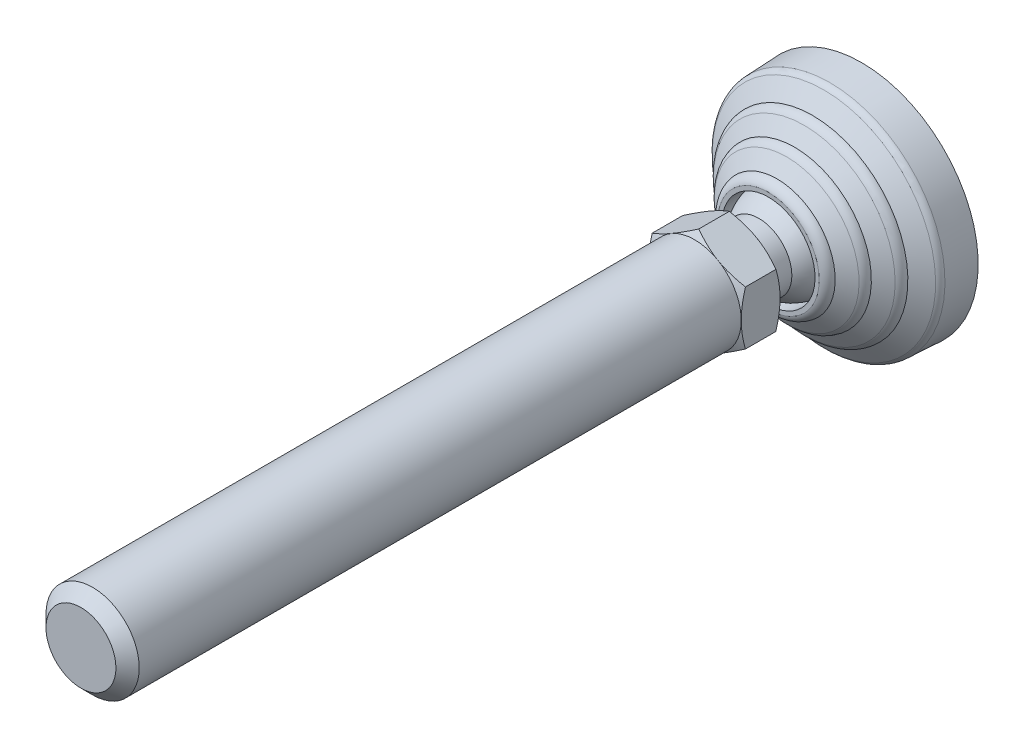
ISO-10303-21;
HEADER;
FILE_DESCRIPTION(('STEP AP214'),'2;1');
FILE_NAME('part.step','',(''),(''),'','','');
FILE_SCHEMA(('AUTOMOTIVE_DESIGN { 1 0 10303 214 1 1 1 1 }'));
ENDSEC;
DATA;
#1=APPLICATION_CONTEXT('core data for automotive mechanical design processes');
#2=APPLICATION_PROTOCOL_DEFINITION('international standard','automotive_design',2000,#1);
#3=PRODUCT_CONTEXT('',#1,'mechanical');
#4=PRODUCT('Part','Part','',(#3));
#5=PRODUCT_RELATED_PRODUCT_CATEGORY('part','',(#4));
#6=PRODUCT_DEFINITION_FORMATION('','',#4);
#7=PRODUCT_DEFINITION_CONTEXT('part definition',#1,'design');
#8=PRODUCT_DEFINITION('design','',#6,#7);
#9=PRODUCT_DEFINITION_SHAPE('','',#8);
#10=(LENGTH_UNIT() NAMED_UNIT(*) SI_UNIT(.MILLI.,.METRE.));
#11=(NAMED_UNIT(*) PLANE_ANGLE_UNIT() SI_UNIT($,.RADIAN.));
#12=(NAMED_UNIT(*) SI_UNIT($,.STERADIAN.) SOLID_ANGLE_UNIT());
#13=UNCERTAINTY_MEASURE_WITH_UNIT(LENGTH_MEASURE(1.E-05),#10,'distance_accuracy_value','');
#14=(GEOMETRIC_REPRESENTATION_CONTEXT(3) GLOBAL_UNCERTAINTY_ASSIGNED_CONTEXT((#13)) GLOBAL_UNIT_ASSIGNED_CONTEXT((#10,
#11,#12)) REPRESENTATION_CONTEXT('',''));
#15=CARTESIAN_POINT('',(0.,0.,0.));
#16=DIRECTION('',(0.,0.,1.));
#17=DIRECTION('',(1.,0.,0.));
#18=AXIS2_PLACEMENT_3D('',#15,#16,#17);
#19=CARTESIAN_POINT('',(0.,0.,30.));
#20=DIRECTION('',(0.,0.,-1.));
#21=DIRECTION('',(0.,1.,0.));
#22=AXIS2_PLACEMENT_3D('',#19,#20,#21);
#23=CYLINDRICAL_SURFACE('',#22,12.);
#24=CARTESIAN_POINT('',(-12.,0.,18.));
#25=CARTESIAN_POINT('',(-12.0000041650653,-0.196349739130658,18.));
#26=CARTESIAN_POINT('',(-11.9951810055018,-0.392699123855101,18.));
#27=CARTESIAN_POINT('',(-11.9759099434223,-0.784925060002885,18.));
#28=CARTESIAN_POINT('',(-11.9614620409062,-0.980801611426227,18.));
#29=CARTESIAN_POINT('',(-11.9229713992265,-1.37160975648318,18.));
#30=CARTESIAN_POINT('',(-11.8989286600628,-1.5665413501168,18.));
#31=CARTESIAN_POINT('',(-11.841307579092,-1.95499003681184,18.));
#32=CARTESIAN_POINT('',(-11.8077292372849,-2.14850712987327,18.));
#33=CARTESIAN_POINT('',(-11.7311174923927,-2.53366059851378,18.));
#34=CARTESIAN_POINT('',(-11.6880840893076,-2.72529697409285,18.));
#35=CARTESIAN_POINT('',(-11.5926659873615,-3.10622734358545,18.));
#36=CARTESIAN_POINT('',(-11.5402812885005,-3.29552133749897,18.));
#37=CARTESIAN_POINT('',(-11.4262867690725,-3.67131091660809,18.));
#38=CARTESIAN_POINT('',(-11.3646769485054,-3.85780650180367,18.));
#39=CARTESIAN_POINT('',(-11.2323806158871,-4.22754997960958,18.));
#40=CARTESIAN_POINT('',(-11.1616941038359,-4.41079787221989,18.));
#41=CARTESIAN_POINT('',(-11.011414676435,-4.77360450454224,18.));
#42=CARTESIAN_POINT('',(-10.9318217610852,-4.95316324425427,18.));
#43=CARTESIAN_POINT('',(-10.7639212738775,-5.30815899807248,18.));
#44=CARTESIAN_POINT('',(-10.6756137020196,-5.48359601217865,18.));
#45=CARTESIAN_POINT('',(-10.4904966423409,-5.82992567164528,17.9999999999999));
#46=CARTESIAN_POINT('',(-10.3936871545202,-6.00081831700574,17.9999999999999));
#47=CARTESIAN_POINT('',(-10.1917994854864,-6.33764754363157,17.9999999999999));
#48=CARTESIAN_POINT('',(-10.0867213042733,-6.50358412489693,17.9999999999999));
#49=CARTESIAN_POINT('',(-9.8685493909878,-6.83010146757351,17.9999999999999));
#50=CARTESIAN_POINT('',(-9.75545565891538,-6.99068222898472,17.9999999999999));
#51=CARTESIAN_POINT('',(-9.5215250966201,-7.30610107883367,17.9999999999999));
#52=CARTESIAN_POINT('',(-9.40068826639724,-7.4609391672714,17.9999999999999));
#53=CARTESIAN_POINT('',(-9.15156261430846,-7.76449965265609,17.9999999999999));
#54=CARTESIAN_POINT('',(-9.02327379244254,-7.91322204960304,17.9999999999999));
#55=CARTESIAN_POINT('',(-8.75955321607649,-8.20419286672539,17.9999999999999));
#56=CARTESIAN_POINT('',(-8.62412146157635,-8.3464412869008,17.9999999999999));
#57=CARTESIAN_POINT('',(-8.3464412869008,-8.62412146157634,17.9999999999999));
#58=CARTESIAN_POINT('',(-8.2041928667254,-8.75955321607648,17.9999999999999));
#59=CARTESIAN_POINT('',(-7.91322204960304,-9.02327379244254,17.9999999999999));
#60=CARTESIAN_POINT('',(-7.76449965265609,-9.15156261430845,17.9999999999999));
#61=CARTESIAN_POINT('',(-7.4609391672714,-9.40068826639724,17.9999999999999));
#62=CARTESIAN_POINT('',(-7.30610107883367,-9.5215250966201,17.9999999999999));
#63=CARTESIAN_POINT('',(-6.99068222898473,-9.75545565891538,17.9999999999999));
#64=CARTESIAN_POINT('',(-6.83010146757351,-9.8685493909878,17.9999999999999));
#65=CARTESIAN_POINT('',(-6.50358412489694,-10.0867213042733,17.9999999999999));
#66=CARTESIAN_POINT('',(-6.33764754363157,-10.1917994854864,17.9999999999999));
#67=CARTESIAN_POINT('',(-6.00081831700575,-10.3936871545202,17.9999999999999));
#68=CARTESIAN_POINT('',(-5.82992567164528,-10.4904966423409,17.9999999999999));
#69=CARTESIAN_POINT('',(-5.48359601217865,-10.6756137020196,17.9999999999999));
#70=CARTESIAN_POINT('',(-5.30815899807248,-10.7639212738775,17.9999999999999));
#71=CARTESIAN_POINT('',(-4.95316324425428,-10.9318217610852,17.9999999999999));
#72=CARTESIAN_POINT('',(-4.77360450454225,-11.011414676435,17.9999999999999));
#73=CARTESIAN_POINT('',(-4.4107978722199,-11.1616941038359,17.9999999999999));
#74=CARTESIAN_POINT('',(-4.22754997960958,-11.2323806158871,17.9999999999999));
#75=CARTESIAN_POINT('',(-3.85780650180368,-11.3646769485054,17.9999999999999));
#76=CARTESIAN_POINT('',(-3.67131091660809,-11.4262867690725,17.9999999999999));
#77=CARTESIAN_POINT('',(-3.29552133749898,-11.5402812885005,17.9999999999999));
#78=CARTESIAN_POINT('',(-3.10622734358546,-11.5926659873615,17.9999999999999));
#79=CARTESIAN_POINT('',(-2.72529697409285,-11.6880840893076,17.9999999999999));
#80=CARTESIAN_POINT('',(-2.53366059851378,-11.7311174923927,17.9999999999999));
#81=CARTESIAN_POINT('',(-2.14850712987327,-11.8077292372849,17.9999999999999));
#82=CARTESIAN_POINT('',(-1.95499003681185,-11.841307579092,17.9999999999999));
#83=CARTESIAN_POINT('',(-1.5665413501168,-11.8989286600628,17.9999999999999));
#84=CARTESIAN_POINT('',(-1.37160975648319,-11.9229713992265,17.9999999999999));
#85=CARTESIAN_POINT('',(-0.980801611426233,-11.9614620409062,17.9999999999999));
#86=CARTESIAN_POINT('',(-0.78492506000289,-11.9759099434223,17.9999999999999));
#87=CARTESIAN_POINT('',(-0.392699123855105,-11.9951810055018,17.9999999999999));
#88=CARTESIAN_POINT('',(-0.196349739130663,-12.0000041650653,17.9999999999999));
#89=CARTESIAN_POINT('',(0.,-12.,17.9999999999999));
#90=B_SPLINE_CURVE_WITH_KNOTS('',3,(#24,#25,#26,#27,#28,#29,#30,#31,#32,#33,#34,#35,#36,#37,#38,
#39,#40,#41,#42,#43,#44,#45,#46,#47,#48,#49,#50,#51,#52,#53,#54,#55,#56,#57,#58,#59,#60,#61,#62,
#63,#64,#65,#66,#67,#68,#69,#70,#71,#72,#73,#74,#75,#76,#77,#78,#79,#80,#81,#82,#83,#84,#85,#86,
#87,#88,#89),.UNSPECIFIED.,.F.,.F.,(4,2,2,2,2,2,2,2,2,2,2,2,2,2,2,2,2,2,2,2,2,2,2,2,2,2,2,2,2,2,
2,2,4),(0.,0.588989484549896,1.17797896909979,1.76696845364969,2.35595793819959,
2.94494742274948,3.53393690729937,4.12292639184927,4.71191587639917,5.30090536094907,
5.88989484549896,6.47888433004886,7.06787381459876,7.65686329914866,8.24585278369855,
8.83484226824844,9.42383175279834,10.0128212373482,10.6018107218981,11.190800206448,
11.7797896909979,12.3687791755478,12.9577686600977,13.5467581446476,14.1357476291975,
14.7247371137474,15.3137265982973,15.9027160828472,16.4917055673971,17.080695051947,
17.6696845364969,18.2586740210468,18.8476635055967),.UNSPECIFIED.);
#91=CARTESIAN_POINT('',(-12.,0.,18.00017943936));
#92=VERTEX_POINT('',#91);
#93=CARTESIAN_POINT('',(0.,-12.,18.));
#94=VERTEX_POINT('',#93);
#95=EDGE_CURVE('E138',#92,#94,#90,.T.);
#96=ORIENTED_EDGE('',*,*,#95,.F.);
#97=CARTESIAN_POINT('',(0.,0.,18.));
#98=DIRECTION('',(0.,0.,-1.));
#99=DIRECTION('',(0.,1.,0.));
#100=AXIS2_PLACEMENT_3D('',#97,#98,#99);
#101=CIRCLE('',#100,12.);
#102=CARTESIAN_POINT('',(0.,12.,18.));
#103=VERTEX_POINT('',#102);
#104=EDGE_CURVE('E134',#103,#92,#101,.F.);
#105=ORIENTED_EDGE('',*,*,#104,.F.);
#106=CARTESIAN_POINT('',(12.,0.,18.));
#107=CARTESIAN_POINT('',(12.0000041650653,0.196349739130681,18.));
#108=CARTESIAN_POINT('',(11.9951810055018,0.392699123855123,18.));
#109=CARTESIAN_POINT('',(11.9759099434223,0.784925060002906,18.));
#110=CARTESIAN_POINT('',(11.9614620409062,0.980801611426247,18.));
#111=CARTESIAN_POINT('',(11.9229713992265,1.3716097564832,18.));
#112=CARTESIAN_POINT('',(11.8989286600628,1.56654135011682,18.));
#113=CARTESIAN_POINT('',(11.841307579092,1.95499003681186,18.));
#114=CARTESIAN_POINT('',(11.8077292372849,2.14850712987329,18.));
#115=CARTESIAN_POINT('',(11.7311174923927,2.53366059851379,18.));
#116=CARTESIAN_POINT('',(11.6880840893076,2.72529697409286,18.));
#117=CARTESIAN_POINT('',(11.5926659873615,3.10622734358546,18.));
#118=CARTESIAN_POINT('',(11.5402812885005,3.29552133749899,18.));
#119=CARTESIAN_POINT('',(11.4262867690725,3.6713109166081,18.));
#120=CARTESIAN_POINT('',(11.3646769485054,3.85780650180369,18.));
#121=CARTESIAN_POINT('',(11.2323806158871,4.22754997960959,18.));
#122=CARTESIAN_POINT('',(11.1616941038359,4.4107978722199,18.));
#123=CARTESIAN_POINT('',(11.011414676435,4.77360450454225,18.));
#124=CARTESIAN_POINT('',(10.9318217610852,4.95316324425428,18.));
#125=CARTESIAN_POINT('',(10.7639212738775,5.30815899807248,18.));
#126=CARTESIAN_POINT('',(10.6756137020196,5.48359601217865,18.));
#127=CARTESIAN_POINT('',(10.4904966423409,5.82992567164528,18.));
#128=CARTESIAN_POINT('',(10.3936871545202,6.00081831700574,18.));
#129=CARTESIAN_POINT('',(10.1917994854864,6.33764754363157,18.));
#130=CARTESIAN_POINT('',(10.0867213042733,6.50358412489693,18.));
#131=CARTESIAN_POINT('',(9.8685493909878,6.83010146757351,18.));
#132=CARTESIAN_POINT('',(9.75545565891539,6.99068222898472,18.));
#133=CARTESIAN_POINT('',(9.5215250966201,7.30610107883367,18.));
#134=CARTESIAN_POINT('',(9.40068826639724,7.4609391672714,18.));
#135=CARTESIAN_POINT('',(9.15156261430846,7.76449965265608,18.));
#136=CARTESIAN_POINT('',(9.02327379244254,7.91322204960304,18.));
#137=CARTESIAN_POINT('',(8.75955321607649,8.20419286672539,18.));
#138=CARTESIAN_POINT('',(8.62412146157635,8.3464412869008,18.));
#139=CARTESIAN_POINT('',(8.34644128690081,8.62412146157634,18.));
#140=CARTESIAN_POINT('',(8.20419286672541,8.75955321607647,18.));
#141=CARTESIAN_POINT('',(7.91322204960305,9.02327379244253,18.));
#142=CARTESIAN_POINT('',(7.7644996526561,9.15156261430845,18.));
#143=CARTESIAN_POINT('',(7.46093916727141,9.40068826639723,18.));
#144=CARTESIAN_POINT('',(7.30610107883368,9.52152509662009,18.));
#145=CARTESIAN_POINT('',(6.99068222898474,9.75545565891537,18.));
#146=CARTESIAN_POINT('',(6.83010146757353,9.86854939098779,18.));
#147=CARTESIAN_POINT('',(6.50358412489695,10.0867213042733,18.));
#148=CARTESIAN_POINT('',(6.33764754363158,10.1917994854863,18.));
#149=CARTESIAN_POINT('',(6.00081831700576,10.3936871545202,18.));
#150=CARTESIAN_POINT('',(5.8299256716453,10.4904966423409,18.));
#151=CARTESIAN_POINT('',(5.48359601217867,10.6756137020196,18.));
#152=CARTESIAN_POINT('',(5.3081589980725,10.7639212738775,18.));
#153=CARTESIAN_POINT('',(4.9531632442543,10.9318217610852,18.));
#154=CARTESIAN_POINT('',(4.77360450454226,11.0114146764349,18.));
#155=CARTESIAN_POINT('',(4.41079787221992,11.1616941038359,18.));
#156=CARTESIAN_POINT('',(4.2275499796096,11.2323806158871,18.));
#157=CARTESIAN_POINT('',(3.85780650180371,11.3646769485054,18.));
#158=CARTESIAN_POINT('',(3.67131091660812,11.4262867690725,18.));
#159=CARTESIAN_POINT('',(3.29552133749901,11.5402812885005,18.));
#160=CARTESIAN_POINT('',(3.10622734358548,11.5926659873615,18.));
#161=CARTESIAN_POINT('',(2.72529697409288,11.6880840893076,18.));
#162=CARTESIAN_POINT('',(2.53366059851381,11.7311174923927,18.));
#163=CARTESIAN_POINT('',(2.1485071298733,11.8077292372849,18.));
#164=CARTESIAN_POINT('',(1.95499003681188,11.841307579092,18.));
#165=CARTESIAN_POINT('',(1.56654135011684,11.8989286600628,18.));
#166=CARTESIAN_POINT('',(1.37160975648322,11.9229713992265,18.));
#167=CARTESIAN_POINT('',(0.980801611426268,11.9614620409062,18.));
#168=CARTESIAN_POINT('',(0.784925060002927,11.9759099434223,18.));
#169=CARTESIAN_POINT('',(0.392699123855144,11.9951810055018,18.));
#170=CARTESIAN_POINT('',(0.196349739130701,12.0000041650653,18.));
#171=CARTESIAN_POINT('',(0.,12.,18.));
#172=B_SPLINE_CURVE_WITH_KNOTS('',3,(#106,#107,#108,#109,#110,#111,#112,#113,#114,#115,#116,
#117,#118,#119,#120,#121,#122,#123,#124,#125,#126,#127,#128,#129,#130,#131,#132,#133,#134,#135,
#136,#137,#138,#139,#140,#141,#142,#143,#144,#145,#146,#147,#148,#149,#150,#151,#152,#153,#154,
#155,#156,#157,#158,#159,#160,#161,#162,#163,#164,#165,#166,#167,#168,#169,#170,#171),
.UNSPECIFIED.,.F.,.F.,(4,2,2,2,2,2,2,2,2,2,2,2,2,2,2,2,2,2,2,2,2,2,2,2,2,2,2,2,2,2,2,2,4),(0.,
0.588989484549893,1.17797896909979,1.76696845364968,2.35595793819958,2.94494742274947,
3.53393690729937,4.12292639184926,4.71191587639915,5.30090536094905,5.88989484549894,
6.47888433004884,7.06787381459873,7.65686329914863,8.24585278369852,8.83484226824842,
9.42383175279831,10.0128212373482,10.6018107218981,11.190800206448,11.7797896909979,
12.3687791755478,12.9577686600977,13.5467581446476,14.1357476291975,14.7247371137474,
15.3137265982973,15.9027160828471,16.491705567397,17.0806950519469,17.6696845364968,
18.2586740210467,18.8476635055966),.UNSPECIFIED.);
#173=CARTESIAN_POINT('',(12.,0.,18.));
#174=VERTEX_POINT('',#173);
#175=EDGE_CURVE('E31',#174,#103,#172,.T.);
#176=ORIENTED_EDGE('',*,*,#175,.F.);
#177=CARTESIAN_POINT('',(0.,0.,18.));
#178=DIRECTION('',(0.,0.,-1.));
#179=DIRECTION('',(0.,1.,0.));
#180=AXIS2_PLACEMENT_3D('',#177,#178,#179);
#181=CIRCLE('',#180,12.);
#182=EDGE_CURVE('E135',#94,#174,#181,.F.);
#183=ORIENTED_EDGE('',*,*,#182,.F.);
#184=EDGE_LOOP('',(#96,#105,#176,#183));
#185=FACE_BOUND('',#184,.T.);
#186=CARTESIAN_POINT('',(0.,0.,24.));
#187=DIRECTION('',(0.,0.,-1.));
#188=DIRECTION('',(0.,1.,0.));
#189=AXIS2_PLACEMENT_3D('',#186,#187,#188);
#190=CIRCLE('',#189,12.);
#191=CARTESIAN_POINT('',(0.,12.,24.));
#192=VERTEX_POINT('',#191);
#193=EDGE_CURVE('E155',#192,#192,#190,.T.);
#194=ORIENTED_EDGE('',*,*,#193,.F.);
#195=EDGE_LOOP('',(#194));
#196=FACE_BOUND('',#195,.T.);
#197=ADVANCED_FACE('F14',(#185,#196),#23,.F.);
#198=CARTESIAN_POINT('',(-6.53226682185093,0.,24.));
#199=DIRECTION('',(0.,0.,1.));
#200=DIRECTION('',(-1.,0.,0.));
#201=AXIS2_PLACEMENT_3D('',#198,#199,#200);
#202=PLANE('',#201);
#203=CARTESIAN_POINT('',(0.,0.,24.));
#204=DIRECTION('',(0.,0.,-1.));
#205=DIRECTION('',(0.,1.,0.));
#206=AXIS2_PLACEMENT_3D('',#203,#204,#205);
#207=CIRCLE('',#206,13.0645336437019);
#208=CARTESIAN_POINT('',(0.,13.0645336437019,24.));
#209=VERTEX_POINT('',#208);
#210=EDGE_CURVE('E151',#209,#209,#207,.T.);
#211=ORIENTED_EDGE('',*,*,#210,.F.);
#212=EDGE_LOOP('',(#211));
#213=FACE_BOUND('',#212,.T.);
#214=ORIENTED_EDGE('',*,*,#193,.T.);
#215=EDGE_LOOP('',(#214));
#216=FACE_BOUND('',#215,.T.);
#217=ADVANCED_FACE('F304',(#213,#216),#202,.T.);
#218=CARTESIAN_POINT('',(0.,0.,21.5842));
#219=DIRECTION('',(0.,0.,-1.));
#220=DIRECTION('',(0.,1.,0.));
#221=AXIS2_PLACEMENT_3D('',#218,#219,#220);
#222=TOROIDAL_SURFACE('',#221,12.5253,2.47525);
#223=ORIENTED_EDGE('',*,*,#210,.T.);
#224=EDGE_LOOP('',(#223));
#225=FACE_BOUND('',#224,.T.);
#226=CARTESIAN_POINT('',(0.,0.,21.8062186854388));
#227=DIRECTION('',(0.,0.,-1.));
#228=DIRECTION('',(-1.,0.,0.));
#229=AXIS2_PLACEMENT_3D('',#226,#227,#228);
#230=CIRCLE('',#229,14.9905728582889);
#231=CARTESIAN_POINT('',(-14.9905728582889,0.,21.8062186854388));
#232=VERTEX_POINT('',#231);
#233=EDGE_CURVE('E154',#232,#232,#230,.T.);
#234=ORIENTED_EDGE('',*,*,#233,.F.);
#235=EDGE_LOOP('',(#234));
#236=FACE_BOUND('',#235,.T.);
#237=ADVANCED_FACE('F382',(#225,#236),#222,.T.);
#238=CARTESIAN_POINT('',(0.,0.,19.3004110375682));
#239=DIRECTION('',(0.,0.,-1.));
#240=DIRECTION('',(0.,1.,0.));
#241=AXIS2_PLACEMENT_3D('',#238,#239,#240);
#242=CONICAL_SURFACE('',#241,18.63040749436,0.967870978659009);
#243=ORIENTED_EDGE('',*,*,#233,.T.);
#244=EDGE_LOOP('',(#243));
#245=FACE_BOUND('',#244,.T.);
#246=CARTESIAN_POINT('',(0.,0.,19.3004110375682));
#247=DIRECTION('',(0.,0.,-1.));
#248=DIRECTION('',(0.,1.,0.));
#249=AXIS2_PLACEMENT_3D('',#246,#247,#248);
#250=CIRCLE('',#249,18.63040749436);
#251=CARTESIAN_POINT('',(0.,18.63040749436,19.3004110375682));
#252=VERTEX_POINT('',#251);
#253=EDGE_CURVE('E376',#252,#252,#250,.T.);
#254=ORIENTED_EDGE('',*,*,#253,.F.);
#255=EDGE_LOOP('',(#254));
#256=FACE_BOUND('',#255,.T.);
#257=ADVANCED_FACE('F369',(#245,#256),#242,.T.);
#258=CARTESIAN_POINT('',(0.,0.,17.149417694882));
#259=DIRECTION('',(0.,0.,-1.));
#260=DIRECTION('',(0.,1.,0.));
#261=AXIS2_PLACEMENT_3D('',#258,#259,#260);
#262=TOROIDAL_SURFACE('',#261,17.1699621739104,2.59993709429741);
#263=CARTESIAN_POINT('',(0.,0.,17.266146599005));
#264=DIRECTION('',(0.,0.,-1.));
#265=DIRECTION('',(-1.,0.,0.));
#266=AXIS2_PLACEMENT_3D('',#263,#264,#265);
#267=CIRCLE('',#266,19.7672775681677);
#268=CARTESIAN_POINT('',(-19.7672775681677,0.,17.266146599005));
#269=VERTEX_POINT('',#268);
#270=EDGE_CURVE('E373',#269,#269,#267,.T.);
#271=ORIENTED_EDGE('',*,*,#270,.F.);
#272=EDGE_LOOP('',(#271));
#273=FACE_BOUND('',#272,.T.);
#274=ORIENTED_EDGE('',*,*,#253,.T.);
#275=EDGE_LOOP('',(#274));
#276=FACE_BOUND('',#275,.T.);
#277=ADVANCED_FACE('F365',(#273,#276),#262,.T.);
#278=CARTESIAN_POINT('',(0.,0.,14.7704000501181));
#279=DIRECTION('',(0.,0.,-1.));
#280=DIRECTION('',(0.,1.,0.));
#281=AXIS2_PLACEMENT_3D('',#278,#279,#280);
#282=CONICAL_SURFACE('',#281,23.3925000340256,0.967871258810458);
#283=CARTESIAN_POINT('',(0.,0.,14.7704000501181));
#284=DIRECTION('',(0.,0.,-1.));
#285=DIRECTION('',(0.,1.,0.));
#286=AXIS2_PLACEMENT_3D('',#283,#284,#285);
#287=CIRCLE('',#286,23.3925000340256);
#288=CARTESIAN_POINT('',(0.,23.3925000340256,14.7704000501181));
#289=VERTEX_POINT('',#288);
#290=EDGE_CURVE('E354',#289,#289,#287,.T.);
#291=ORIENTED_EDGE('',*,*,#290,.F.);
#292=EDGE_LOOP('',(#291));
#293=FACE_BOUND('',#292,.T.);
#294=ORIENTED_EDGE('',*,*,#270,.T.);
#295=EDGE_LOOP('',(#294));
#296=FACE_BOUND('',#295,.T.);
#297=ADVANCED_FACE('F361',(#293,#296),#282,.T.);
#298=CARTESIAN_POINT('',(0.,0.,12.6193000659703));
#299=DIRECTION('',(0.,0.,-1.));
#300=DIRECTION('',(0.,1.,0.));
#301=AXIS2_PLACEMENT_3D('',#298,#299,#300);
#302=TOROIDAL_SURFACE('',#301,21.9321002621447,2.59999973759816);
#303=ORIENTED_EDGE('',*,*,#290,.T.);
#304=EDGE_LOOP('',(#303));
#305=FACE_BOUND('',#304,.T.);
#306=CARTESIAN_POINT('',(0.,0.,12.6295138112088));
#307=DIRECTION('',(0.,0.,-1.));
#308=DIRECTION('',(-1.,0.,0.));
#309=AXIS2_PLACEMENT_3D('',#306,#307,#308);
#310=CIRCLE('',#309,24.5320799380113);
#311=CARTESIAN_POINT('',(-24.5320799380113,0.,12.6295138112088));
#312=VERTEX_POINT('',#311);
#313=EDGE_CURVE('E351',#312,#312,#310,.T.);
#314=ORIENTED_EDGE('',*,*,#313,.F.);
#315=EDGE_LOOP('',(#314));
#316=FACE_BOUND('',#315,.T.);
#317=ADVANCED_FACE('F358',(#305,#316),#302,.T.);
#318=CARTESIAN_POINT('',(0.,0.,9.71835625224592));
#319=DIRECTION('',(0.,0.,-1.));
#320=DIRECTION('',(0.,1.,0.));
#321=AXIS2_PLACEMENT_3D('',#318,#319,#320);
#322=CONICAL_SURFACE('',#321,28.760790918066,0.967879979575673);
#323=ORIENTED_EDGE('',*,*,#313,.T.);
#324=EDGE_LOOP('',(#323));
#325=FACE_BOUND('',#324,.T.);
#326=CARTESIAN_POINT('',(0.,0.,9.71835625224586));
#327=DIRECTION('',(0.,0.,-1.));
#328=DIRECTION('',(0.,1.,0.));
#329=AXIS2_PLACEMENT_3D('',#326,#327,#328);
#330=CIRCLE('',#329,28.760790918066);
#331=CARTESIAN_POINT('',(0.,28.760790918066,9.71835625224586));
#332=VERTEX_POINT('',#331);
#333=EDGE_CURVE('E348',#332,#332,#330,.T.);
#334=ORIENTED_EDGE('',*,*,#333,.F.);
#335=EDGE_LOOP('',(#334));
#336=FACE_BOUND('',#335,.T.);
#337=ADVANCED_FACE('F341',(#325,#336),#322,.T.);
#338=CARTESIAN_POINT('',(0.,0.,8.07109690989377));
#339=DIRECTION('',(0.,0.,-1.));
#340=DIRECTION('',(0.,1.,0.));
#341=AXIS2_PLACEMENT_3D('',#338,#339,#340);
#342=TOROIDAL_SURFACE('',#341,27.6268354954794,1.9998295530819);
#343=CARTESIAN_POINT('',(0.,0.,8.17566154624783));
#344=DIRECTION('',(0.,0.,-1.));
#345=DIRECTION('',(-1.,0.,0.));
#346=AXIS2_PLACEMENT_3D('',#343,#344,#345);
#347=CIRCLE('',#346,29.6239295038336);
#348=CARTESIAN_POINT('',(-29.6239295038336,0.,8.17566154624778));
#349=VERTEX_POINT('',#348);
#350=EDGE_CURVE('E150',#349,#349,#347,.T.);
#351=ORIENTED_EDGE('',*,*,#350,.F.);
#352=EDGE_LOOP('',(#351));
#353=FACE_BOUND('',#352,.T.);
#354=ORIENTED_EDGE('',*,*,#333,.T.);
#355=EDGE_LOOP('',(#354));
#356=FACE_BOUND('',#355,.T.);
#357=ADVANCED_FACE('F336',(#353,#356),#342,.T.);
#358=CARTESIAN_POINT('',(0.,0.,0.));
#359=DIRECTION('',(0.,0.,-1.));
#360=DIRECTION('',(0.,1.,0.));
#361=AXIS2_PLACEMENT_3D('',#358,#359,#360);
#362=CONICAL_SURFACE('',#361,30.,0.0459663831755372);
#363=CARTESIAN_POINT('',(0.,0.,0.));
#364=DIRECTION('',(0.,0.,-1.));
#365=DIRECTION('',(0.,1.,0.));
#366=AXIS2_PLACEMENT_3D('',#363,#364,#365);
#367=CIRCLE('',#366,30.);
#368=CARTESIAN_POINT('',(0.,30.,0.));
#369=VERTEX_POINT('',#368);
#370=EDGE_CURVE('E147',#369,#369,#367,.T.);
#371=ORIENTED_EDGE('',*,*,#370,.F.);
#372=EDGE_LOOP('',(#371));
#373=FACE_BOUND('',#372,.T.);
#374=ORIENTED_EDGE('',*,*,#350,.T.);
#375=EDGE_LOOP('',(#374));
#376=FACE_BOUND('',#375,.T.);
#377=ADVANCED_FACE('F296',(#373,#376),#362,.T.);
#378=CARTESIAN_POINT('',(-15.,0.,0.));
#379=DIRECTION('',(0.,0.,-1.));
#380=DIRECTION('',(0.,1.,0.));
#381=AXIS2_PLACEMENT_3D('',#378,#379,#380);
#382=PLANE('',#381);
#383=ORIENTED_EDGE('',*,*,#370,.T.);
#384=EDGE_LOOP('',(#383));
#385=FACE_BOUND('',#384,.T.);
#386=ADVANCED_FACE('F117',(#385),#382,.T.);
#387=CARTESIAN_POINT('',(0.,0.,90.1595));
#388=DIRECTION('',(0.,0.,-1.));
#389=DIRECTION('',(0.,1.,0.));
#390=AXIS2_PLACEMENT_3D('',#387,#388,#389);
#391=CYLINDRICAL_SURFACE('',#390,12.);
#392=CARTESIAN_POINT('',(0.,0.,198.));
#393=DIRECTION('',(0.,0.,1.));
#394=DIRECTION('',(0.,-1.,0.));
#395=AXIS2_PLACEMENT_3D('',#392,#393,#394);
#396=CIRCLE('',#395,12.);
#397=CARTESIAN_POINT('',(0.,-12.,198.));
#398=VERTEX_POINT('',#397);
#399=EDGE_CURVE('E9',#398,#398,#396,.F.);
#400=ORIENTED_EDGE('',*,*,#399,.T.);
#401=EDGE_LOOP('',(#400));
#402=FACE_BOUND('',#401,.T.);
#403=CARTESIAN_POINT('',(0.,0.,43.));
#404=DIRECTION('',(0.,0.,-1.));
#405=DIRECTION('',(0.,1.,0.));
#406=AXIS2_PLACEMENT_3D('',#403,#404,#405);
#407=CIRCLE('',#406,12.);
#408=CARTESIAN_POINT('',(0.,12.,43.));
#409=VERTEX_POINT('',#408);
#410=EDGE_CURVE('E136',#409,#409,#407,.F.);
#411=ORIENTED_EDGE('',*,*,#410,.T.);
#412=EDGE_LOOP('',(#411));
#413=FACE_BOUND('',#412,.T.);
#414=ADVANCED_FACE('F287',(#402,#413),#391,.T.);
#415=CARTESIAN_POINT('',(11.995,0.,43.));
#416=DIRECTION('',(0.,0.,-1.));
#417=DIRECTION('',(0.,1.,0.));
#418=AXIS2_PLACEMENT_3D('',#415,#416,#417);
#419=PLANE('',#418);
#420=CARTESIAN_POINT('',(0.,0.,43.));
#421=DIRECTION('',(0.,0.,-1.));
#422=DIRECTION('',(0.,1.,0.));
#423=AXIS2_PLACEMENT_3D('',#420,#421,#422);
#424=CIRCLE('',#423,11.99);
#425=CARTESIAN_POINT('',(0.,11.99,43.));
#426=VERTEX_POINT('',#425);
#427=EDGE_CURVE('E575',#426,#426,#424,.F.);
#428=ORIENTED_EDGE('',*,*,#427,.T.);
#429=EDGE_LOOP('',(#428));
#430=FACE_BOUND('',#429,.T.);
#431=ORIENTED_EDGE('',*,*,#410,.F.);
#432=EDGE_LOOP('',(#431));
#433=FACE_BOUND('',#432,.T.);
#434=ADVANCED_FACE('F254',(#430,#433),#419,.T.);
#435=CARTESIAN_POINT('',(0.,0.,41.9159643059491));
#436=DIRECTION('',(0.,0.,-1.));
#437=DIRECTION('',(0.,1.,0.));
#438=AXIS2_PLACEMENT_3D('',#435,#436,#437);
#439=CONICAL_SURFACE('',#438,13.8676048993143,1.0471975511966);
#440=ORIENTED_EDGE('',*,*,#427,.F.);
#441=EDGE_LOOP('',(#440));
#442=FACE_BOUND('',#441,.T.);
#443=CARTESIAN_POINT('',(-2.30779106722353E-08,13.856406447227,41.9224297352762));
#444=CARTESIAN_POINT('',(-0.263784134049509,13.7041106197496,42.0103407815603));
#445=CARTESIAN_POINT('',(-0.528551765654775,13.5512469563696,42.0942615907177));
#446=CARTESIAN_POINT('',(-1.06021024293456,13.2442937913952,42.2530155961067));
#447=CARTESIAN_POINT('',(-1.32710175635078,13.0902039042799,42.3278458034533));
#448=CARTESIAN_POINT('',(-2.13207652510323,12.6254515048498,42.5372522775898));
#449=CARTESIAN_POINT('',(-2.6733374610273,12.3129543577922,42.656360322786));
#450=CARTESIAN_POINT('',(-3.48330959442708,11.8453167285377,42.7960231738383));
#451=CARTESIAN_POINT('',(-3.74960112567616,11.6915732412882,42.8358073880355));
#452=CARTESIAN_POINT('',(-4.28341703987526,11.3833744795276,42.9025217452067));
#453=CARTESIAN_POINT('',(-4.550941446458,11.2289191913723,42.9294516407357));
#454=CARTESIAN_POINT('',(-5.08643618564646,10.9197511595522,42.9697675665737));
#455=CARTESIAN_POINT('',(-5.35440560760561,10.7650389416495,42.9831696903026));
#456=CARTESIAN_POINT('',(-5.89059263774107,10.4554712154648,42.9961444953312));
#457=CARTESIAN_POINT('',(-6.15881023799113,10.300615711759,42.9957176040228));
#458=CARTESIAN_POINT('',(-6.66023033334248,10.0111206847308,42.9820002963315));
#459=CARTESIAN_POINT('',(-6.89346861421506,9.87646050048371,42.9703830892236));
#460=CARTESIAN_POINT('',(-7.359408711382,9.60744985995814,42.9369099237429));
#461=CARTESIAN_POINT('',(-7.59211048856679,9.4730994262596,42.9150532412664));
#462=CARTESIAN_POINT('',(-8.05685112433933,9.20478129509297,42.8614821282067));
#463=CARTESIAN_POINT('',(-8.28888927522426,9.07081400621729,42.8297595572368));
#464=CARTESIAN_POINT('',(-8.75187778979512,8.8035074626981,42.7570131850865));
#465=CARTESIAN_POINT('',(-8.98282807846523,8.67016825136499,42.7159887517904));
#466=CARTESIAN_POINT('',(-9.68388988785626,8.26541002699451,42.5779256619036));
#467=CARTESIAN_POINT('',(-10.1519713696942,7.9951630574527,42.4671213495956));
#468=CARTESIAN_POINT('',(-11.0811551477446,7.45869855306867,42.2156417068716));
#469=CARTESIAN_POINT('',(-11.5422693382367,7.19247415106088,42.0750254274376));
#470=CARTESIAN_POINT('',(-11.9999999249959,6.92820327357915,41.922429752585));
#471=B_SPLINE_CURVE_WITH_KNOTS('',3,(#443,#444,#445,#446,#447,#448,#449,#450,#451,#452,#453,
#454,#455,#456,#457,#458,#459,#460,#461,#462,#463,#464,#465,#466,#467,#468,#469,#470),
.UNSPECIFIED.,.F.,.F.,(4,2,2,2,2,2,2,2,2,2,2,2,2,4),(0.,0.950996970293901,1.90230577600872,
3.80897260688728,4.73890630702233,5.6688579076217,6.59770187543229,7.52651713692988,
8.33503480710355,9.14360966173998,9.95285345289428,10.7621522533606,12.4163367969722,
14.0672748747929),.UNSPECIFIED.);
#472=CARTESIAN_POINT('',(-1.15389586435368E-08,13.856406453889,41.92242973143));
#473=VERTEX_POINT('',#472);
#474=CARTESIAN_POINT('',(-12.,6.92820324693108,41.9224297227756));
#475=VERTEX_POINT('',#474);
#476=EDGE_CURVE('E100',#473,#475,#471,.T.);
#477=ORIENTED_EDGE('',*,*,#476,.T.);
#478=CARTESIAN_POINT('',(-12.,6.92820326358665,41.9224297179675));
#479=CARTESIAN_POINT('',(-12.,6.64374493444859,42.0045333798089));
#480=CARTESIAN_POINT('',(-12.,6.35829458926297,42.0831531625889));
#481=CARTESIAN_POINT('',(-12.,5.78524260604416,42.2325348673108));
#482=CARTESIAN_POINT('',(-12.,5.49764024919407,42.3032940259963));
#483=CARTESIAN_POINT('',(-12.,4.63053083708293,42.5026195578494));
#484=CARTESIAN_POINT('',(-12.,4.04782834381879,42.6179071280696));
#485=CARTESIAN_POINT('',(-12.,3.17548925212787,42.7575170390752));
#486=CARTESIAN_POINT('',(-12.,2.88840964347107,42.7982045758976));
#487=CARTESIAN_POINT('',(-12.,2.31290718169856,42.8685767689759));
#488=CARTESIAN_POINT('',(-12.,2.02448443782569,42.8982623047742));
#489=CARTESIAN_POINT('',(-12.,1.44696804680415,42.9459902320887));
#490=CARTESIAN_POINT('',(-12.,1.15787537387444,42.9640443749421));
#491=CARTESIAN_POINT('',(-12.,0.579188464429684,42.9881624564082));
#492=CARTESIAN_POINT('',(-12.,0.289594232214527,42.994226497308));
#493=CARTESIAN_POINT('',(-12.,-0.289594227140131,42.9942264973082));
#494=CARTESIAN_POINT('',(-12.,-0.579188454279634,42.9881624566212));
#495=CARTESIAN_POINT('',(-12.,-1.15787535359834,42.9640443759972));
#496=CARTESIAN_POINT('',(-12.,-1.44696802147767,42.9459902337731));
#497=CARTESIAN_POINT('',(-12.,-2.02448440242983,42.8982623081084));
#498=CARTESIAN_POINT('',(-12.,-2.31290714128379,42.8685767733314));
#499=CARTESIAN_POINT('',(-12.,-2.88840959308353,42.798204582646));
#500=CARTESIAN_POINT('',(-12.,-3.17548919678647,42.7575170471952));
#501=CARTESIAN_POINT('',(-12.,-4.04782827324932,42.6179071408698));
#502=CARTESIAN_POINT('',(-12.,-4.63053075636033,42.5026195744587));
#503=CARTESIAN_POINT('',(-12.,-5.49764015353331,42.3032940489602));
#504=CARTESIAN_POINT('',(-12.,-5.78524250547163,42.2325348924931));
#505=CARTESIAN_POINT('',(-12.,-6.35829447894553,42.0831531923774));
#506=CARTESIAN_POINT('',(-12.,-6.64374481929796,42.004533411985));
#507=CARTESIAN_POINT('',(-12.,-6.92820314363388,41.9224297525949));
#508=B_SPLINE_CURVE_WITH_KNOTS('',3,(#478,#479,#480,#481,#482,#483,#484,#485,#486,#487,#488,
#489,#490,#491,#492,#493,#494,#495,#496,#497,#498,#499,#500,#501,#502,#503,#504,#505,#506,#507),
.UNSPECIFIED.,.F.,.F.,(4,2,2,2,2,2,2,2,2,2,2,2,2,2,4),(0.,0.888148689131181,1.77660860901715,
3.55698615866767,4.42666281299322,5.2962699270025,6.16499708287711,7.03371682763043,
7.90243655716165,8.7711636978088,9.64077079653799,10.5104474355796,12.2908249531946,
13.1792848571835,14.0674335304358),.UNSPECIFIED.);
#509=CARTESIAN_POINT('',(-12.0000000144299,-6.92820322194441,41.9224297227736));
#510=VERTEX_POINT('',#509);
#511=EDGE_CURVE('E268',#475,#510,#508,.T.);
#512=ORIENTED_EDGE('',*,*,#511,.T.);
#513=CARTESIAN_POINT('',(-12.0000000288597,-6.92820321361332,41.9224297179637));
#514=CARTESIAN_POINT('',(-11.7362159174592,-7.08049904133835,42.0103407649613));
#515=CARTESIAN_POINT('',(-11.471448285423,-7.23336270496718,42.0942615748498));
#516=CARTESIAN_POINT('',(-10.9397898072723,-7.54031587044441,42.2530155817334));
#517=CARTESIAN_POINT('',(-10.6728982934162,-7.69440575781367,42.3278457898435));
#518=CARTESIAN_POINT('',(-9.86792352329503,-8.15915815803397,42.5372522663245));
#519=CARTESIAN_POINT('',(-9.32666258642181,-8.47165530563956,42.6563603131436));
#520=CARTESIAN_POINT('',(-8.51669045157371,-8.93929293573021,42.7960231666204));
#521=CARTESIAN_POINT('',(-8.25039891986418,-9.09303642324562,42.8358073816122));
#522=CARTESIAN_POINT('',(-7.71658300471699,-9.40123518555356,42.9025217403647));
#523=CARTESIAN_POINT('',(-7.44905859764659,-9.55569047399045,42.9294516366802));
#524=CARTESIAN_POINT('',(-6.91356385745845,-9.8648585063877,42.9697675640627));
#525=CARTESIAN_POINT('',(-6.64559443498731,-10.019570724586,42.9831696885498));
#526=CARTESIAN_POINT('',(-6.10940740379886,-10.3291384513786,42.996144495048));
#527=CARTESIAN_POINT('',(-5.84118980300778,-10.4839939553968,42.9957176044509));
#528=CARTESIAN_POINT('',(-5.33976970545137,-10.7734889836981,42.9820002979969));
#529=CARTESIAN_POINT('',(-5.10653142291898,-10.9081491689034,42.9703830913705));
#530=CARTESIAN_POINT('',(-4.64059132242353,-11.1771598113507,42.9369099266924));
#531=CARTESIAN_POINT('',(-4.40788954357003,-11.3115102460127,42.9150532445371));
#532=CARTESIAN_POINT('',(-3.94314890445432,-11.5798283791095,42.8614821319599));
#533=CARTESIAN_POINT('',(-3.71111075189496,-11.7137956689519,42.829759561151));
#534=CARTESIAN_POINT('',(-3.24812223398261,-11.9811022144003,42.7570131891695));
#535=CARTESIAN_POINT('',(-3.01717194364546,-12.1144414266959,42.7159887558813));
#536=CARTESIAN_POINT('',(-2.31611012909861,-12.5191996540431,42.5779256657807));
#537=CARTESIAN_POINT('',(-1.84802864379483,-12.7894466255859,42.4671213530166));
#538=CARTESIAN_POINT('',(-0.918844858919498,-13.3259111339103,42.215641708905));
#539=CARTESIAN_POINT('',(-0.457730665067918,-13.5921355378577,42.0750254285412));
#540=CARTESIAN_POINT('',(-7.50040968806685E-08,-13.8564064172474,41.922429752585));
#541=B_SPLINE_CURVE_WITH_KNOTS('',3,(#513,#514,#515,#516,#517,#518,#519,#520,#521,#522,#523,
#524,#525,#526,#527,#528,#529,#530,#531,#532,#533,#534,#535,#536,#537,#538,#539,#540),
.UNSPECIFIED.,.F.,.F.,(4,2,2,2,2,2,2,2,2,2,2,2,2,4),(0.,0.950996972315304,1.90230578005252,
3.80897261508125,4.73890631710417,5.66885791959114,6.59770188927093,7.52651715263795,
8.33503482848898,9.14360968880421,9.95285348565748,10.7621522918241,12.4163368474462,
14.0672749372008),.UNSPECIFIED.);
#542=CARTESIAN_POINT('',(-1.44241383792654E-08,-13.8564064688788,41.9224297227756));
#543=VERTEX_POINT('',#542);
#544=EDGE_CURVE('E239',#510,#543,#541,.T.);
#545=ORIENTED_EDGE('',*,*,#544,.T.);
#546=CARTESIAN_POINT('',(-2.88482840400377E-08,-13.8564064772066,41.9224297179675));
#547=CARTESIAN_POINT('',(0.263784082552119,-13.7041106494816,42.0103407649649));
#548=CARTESIAN_POINT('',(0.528551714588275,-13.5512469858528,42.0942615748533));
#549=CARTESIAN_POINT('',(1.06021019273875,-13.2442938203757,42.2530155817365));
#550=CARTESIAN_POINT('',(1.32710170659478,-13.0902039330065,42.3278457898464));
#551=CARTESIAN_POINT('',(2.13207647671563,-12.6254515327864,42.537252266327));
#552=CARTESIAN_POINT('',(2.67333741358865,-12.3129543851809,42.6563603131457));
#553=CARTESIAN_POINT('',(3.48330954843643,-11.8453167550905,42.796023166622));
#554=CARTESIAN_POINT('',(3.74960108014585,-11.6915732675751,42.8358073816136));
#555=CARTESIAN_POINT('',(4.28341699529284,-11.3833745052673,42.9025217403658));
#556=CARTESIAN_POINT('',(4.55094140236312,-11.2289192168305,42.9294516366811));
#557=CARTESIAN_POINT('',(5.08643614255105,-10.9197511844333,42.9697675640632));
#558=CARTESIAN_POINT('',(5.35440556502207,-10.7650389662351,42.9831696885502));
#559=CARTESIAN_POINT('',(5.8905925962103,-10.4554712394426,42.996144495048));
#560=CARTESIAN_POINT('',(6.15881019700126,-10.3006157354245,42.9957176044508));
#561=CARTESIAN_POINT('',(6.66023029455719,-10.0111207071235,42.9820002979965));
#562=CARTESIAN_POINT('',(6.8934685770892,-9.87646052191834,42.97038309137));
#563=CARTESIAN_POINT('',(7.35940867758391,-9.60744987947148,42.9369099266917));
#564=CARTESIAN_POINT('',(7.59211045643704,-9.47309944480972,42.9150532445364));
#565=CARTESIAN_POINT('',(8.05685109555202,-9.20478131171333,42.8614821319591));
#566=CARTESIAN_POINT('',(8.28888924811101,-9.07081402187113,42.8297595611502));
#567=CARTESIAN_POINT('',(8.75187776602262,-8.80350747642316,42.7570131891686));
#568=CARTESIAN_POINT('',(8.9828280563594,-8.6701682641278,42.7159887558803));
#569=CARTESIAN_POINT('',(9.68388987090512,-8.26541003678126,42.5779256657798));
#570=CARTESIAN_POINT('',(10.1519713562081,-7.99516306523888,42.4671213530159));
#571=CARTESIAN_POINT('',(11.081155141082,-7.45869855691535,42.2156417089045));
#572=CARTESIAN_POINT('',(11.5422693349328,-7.19247415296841,42.075025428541));
#573=CARTESIAN_POINT('',(11.9999999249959,-6.92820327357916,41.922429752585));
#574=B_SPLINE_CURVE_WITH_KNOTS('',3,(#546,#547,#548,#549,#550,#551,#552,#553,#554,#555,#556,
#557,#558,#559,#560,#561,#562,#563,#564,#565,#566,#567,#568,#569,#570,#571,#572,#573),
.UNSPECIFIED.,.F.,.F.,(4,2,2,2,2,2,2,2,2,2,2,2,2,4),(0.,0.950996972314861,1.90230578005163,
3.80897261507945,4.73890631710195,5.66885791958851,6.59770188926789,7.52651715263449,
8.33503482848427,9.14360968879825,9.95285348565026,10.7621522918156,12.4163368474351,
14.0672749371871),.UNSPECIFIED.);
#575=CARTESIAN_POINT('',(12.,-6.92820324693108,41.9224297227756));
#576=VERTEX_POINT('',#575);
#577=EDGE_CURVE('E230',#543,#576,#574,.T.);
#578=ORIENTED_EDGE('',*,*,#577,.T.);
#579=CARTESIAN_POINT('',(12.,-6.92820326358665,41.9224297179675));
#580=CARTESIAN_POINT('',(12.,-6.64374493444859,42.0045333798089));
#581=CARTESIAN_POINT('',(12.,-6.35829458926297,42.0831531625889));
#582=CARTESIAN_POINT('',(12.,-5.78524260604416,42.2325348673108));
#583=CARTESIAN_POINT('',(12.,-5.49764024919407,42.3032940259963));
#584=CARTESIAN_POINT('',(12.,-4.63053083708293,42.5026195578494));
#585=CARTESIAN_POINT('',(12.,-4.04782834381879,42.6179071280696));
#586=CARTESIAN_POINT('',(12.,-3.17548925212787,42.7575170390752));
#587=CARTESIAN_POINT('',(12.,-2.88840964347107,42.7982045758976));
#588=CARTESIAN_POINT('',(12.,-2.31290718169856,42.8685767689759));
#589=CARTESIAN_POINT('',(12.,-2.02448443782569,42.8982623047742));
#590=CARTESIAN_POINT('',(12.,-1.44696804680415,42.9459902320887));
#591=CARTESIAN_POINT('',(12.,-1.15787537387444,42.9640443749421));
#592=CARTESIAN_POINT('',(12.,-0.579188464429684,42.9881624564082));
#593=CARTESIAN_POINT('',(12.,-0.289594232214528,42.994226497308));
#594=CARTESIAN_POINT('',(12.,0.289594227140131,42.9942264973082));
#595=CARTESIAN_POINT('',(12.,0.579188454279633,42.9881624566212));
#596=CARTESIAN_POINT('',(12.,1.15787535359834,42.9640443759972));
#597=CARTESIAN_POINT('',(12.,1.44696802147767,42.9459902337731));
#598=CARTESIAN_POINT('',(12.,2.02448440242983,42.8982623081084));
#599=CARTESIAN_POINT('',(12.,2.31290714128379,42.8685767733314));
#600=CARTESIAN_POINT('',(12.,2.88840959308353,42.798204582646));
#601=CARTESIAN_POINT('',(12.,3.17548919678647,42.7575170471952));
#602=CARTESIAN_POINT('',(12.,4.04782827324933,42.6179071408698));
#603=CARTESIAN_POINT('',(12.,4.63053075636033,42.5026195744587));
#604=CARTESIAN_POINT('',(12.,5.49764015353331,42.3032940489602));
#605=CARTESIAN_POINT('',(12.,5.78524250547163,42.2325348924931));
#606=CARTESIAN_POINT('',(12.,6.35829447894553,42.0831531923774));
#607=CARTESIAN_POINT('',(12.,6.64374481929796,42.004533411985));
#608=CARTESIAN_POINT('',(12.,6.92820314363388,41.9224297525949));
#609=B_SPLINE_CURVE_WITH_KNOTS('',3,(#579,#580,#581,#582,#583,#584,#585,#586,#587,#588,#589,
#590,#591,#592,#593,#594,#595,#596,#597,#598,#599,#600,#601,#602,#603,#604,#605,#606,#607,#608),
.UNSPECIFIED.,.F.,.F.,(4,2,2,2,2,2,2,2,2,2,2,2,2,2,4),(0.,0.888148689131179,1.77660860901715,
3.55698615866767,4.42666281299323,5.2962699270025,6.16499708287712,7.03371682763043,
7.90243655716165,8.7711636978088,9.64077079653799,10.5104474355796,12.2908249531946,
13.1792848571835,14.0674335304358),.UNSPECIFIED.);
#610=CARTESIAN_POINT('',(12.0000000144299,6.92820322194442,41.9224297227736));
#611=VERTEX_POINT('',#610);
#612=EDGE_CURVE('E238',#576,#611,#609,.T.);
#613=ORIENTED_EDGE('',*,*,#612,.T.);
#614=CARTESIAN_POINT('',(12.0000000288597,6.92820321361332,41.9224297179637));
#615=CARTESIAN_POINT('',(11.7362159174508,7.08049904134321,42.0103407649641));
#616=CARTESIAN_POINT('',(11.4714482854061,7.23336270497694,42.0942615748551));
#617=CARTESIAN_POINT('',(10.9397898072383,7.54031587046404,42.2530155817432));
#618=CARTESIAN_POINT('',(10.6728982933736,7.69440575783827,42.3278457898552));
#619=CARTESIAN_POINT('',(9.86792352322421,8.15915815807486,42.5372522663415));
#620=CARTESIAN_POINT('',(9.32666258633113,8.47165530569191,42.6563603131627));
#621=CARTESIAN_POINT('',(8.51669045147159,8.93929293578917,42.7960231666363));
#622=CARTESIAN_POINT('',(8.25039891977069,9.0930364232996,42.8358073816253));
#623=CARTESIAN_POINT('',(7.71658300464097,9.40123518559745,42.9025217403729));
#624=CARTESIAN_POINT('',(7.44905859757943,9.55569047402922,42.9294516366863));
#625=CARTESIAN_POINT('',(6.91356385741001,9.86485850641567,42.9697675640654));
#626=CARTESIAN_POINT('',(6.64559443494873,10.0195707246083,42.9831696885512));
#627=CARTESIAN_POINT('',(6.10940740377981,10.3291384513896,42.996144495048));
#628=CARTESIAN_POINT('',(5.84118980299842,10.4839939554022,42.9957176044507));
#629=CARTESIAN_POINT('',(5.33976970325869,10.773488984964,42.9820002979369));
#630=CARTESIAN_POINT('',(5.10653141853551,10.9081491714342,42.970383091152));
#631=CARTESIAN_POINT('',(4.64059131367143,11.1771598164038,42.9369099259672));
#632=CARTESIAN_POINT('',(4.4078895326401,11.3115102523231,42.9150532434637));
#633=CARTESIAN_POINT('',(3.94314888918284,11.5798283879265,42.8614821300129));
#634=CARTESIAN_POINT('',(3.71111073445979,11.7137956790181,42.8297595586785));
#635=CARTESIAN_POINT('',(3.24812221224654,11.9811022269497,42.7570131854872));
#636=CARTESIAN_POINT('',(3.01717191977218,12.1144414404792,42.7159887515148));
#637=CARTESIAN_POINT('',(2.31611009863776,12.5191996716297,42.5779256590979));
#638=CARTESIAN_POINT('',(1.84802860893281,12.7894466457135,42.4671213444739));
#639=CARTESIAN_POINT('',(0.918844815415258,13.3259111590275,42.2156416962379));
#640=CARTESIAN_POINT('',(0.457730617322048,13.5921355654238,42.0750254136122));
#641=CARTESIAN_POINT('',(2.30778996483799E-08,13.856406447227,41.9224297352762));
#642=B_SPLINE_CURVE_WITH_KNOTS('',3,(#614,#615,#616,#617,#618,#619,#620,#621,#622,#623,#624,
#625,#626,#627,#628,#629,#630,#631,#632,#633,#634,#635,#636,#637,#638,#639,#640,#641),
.UNSPECIFIED.,.F.,.F.,(4,2,2,2,2,2,2,2,2,2,2,2,2,4),(0.,0.95099697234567,1.9023057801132,
3.8089726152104,4.73890631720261,5.66885791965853,6.59770188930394,7.52651715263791,
8.33503483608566,9.14360970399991,9.95285350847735,10.7621523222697,12.4163368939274,
14.0672749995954),.UNSPECIFIED.);
#643=EDGE_CURVE('E259',#611,#473,#642,.T.);
#644=ORIENTED_EDGE('',*,*,#643,.T.);
#645=EDGE_LOOP('',(#477,#512,#545,#578,#613,#644));
#646=FACE_BOUND('',#645,.T.);
#647=ADVANCED_FACE('F250',(#442,#646),#439,.T.);
#648=CARTESIAN_POINT('',(0.,-13.856406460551,43.1));
#649=DIRECTION('',(0.5,0.866025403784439,0.));
#650=DIRECTION('',(-0.866025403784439,0.5,0.));
#651=AXIS2_PLACEMENT_3D('',#648,#649,#650);
#652=PLANE('',#651);
#653=DIRECTION('',(0.,0.,1.));
#654=VECTOR('',#653,1.);
#655=CARTESIAN_POINT('',(0.,-13.856406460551,43.1));
#656=LINE('',#655,#654);
#657=CARTESIAN_POINT('',(0.,-13.856406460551,34.0775702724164));
#658=VERTEX_POINT('',#657);
#659=EDGE_CURVE('E163',#658,#543,#656,.T.);
#660=ORIENTED_EDGE('',*,*,#659,.T.);
#661=ORIENTED_EDGE('',*,*,#544,.F.);
#662=DIRECTION('',(0.,0.,1.));
#663=VECTOR('',#662,1.);
#664=CARTESIAN_POINT('',(-12.,-6.9282032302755,43.1));
#665=LINE('',#664,#663);
#666=CARTESIAN_POINT('',(-12.,-6.9282032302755,34.0775702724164));
#667=VERTEX_POINT('',#666);
#668=EDGE_CURVE('E165',#667,#510,#665,.T.);
#669=ORIENTED_EDGE('',*,*,#668,.F.);
#670=CARTESIAN_POINT('',(0.,-13.856406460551,34.0775702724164));
#671=CARTESIAN_POINT('',(-0.263784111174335,-13.7041106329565,33.9896592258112));
#672=CARTESIAN_POINT('',(-0.528551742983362,-13.5512469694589,33.9057384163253));
#673=CARTESIAN_POINT('',(-1.0602102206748,-13.2442938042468,33.7469844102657));
#674=CARTESIAN_POINT('',(-1.32710173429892,-13.0902039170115,33.6721542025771));
#675=CARTESIAN_POINT('',(-2.13207650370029,-12.6254515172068,33.4627477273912));
#676=CARTESIAN_POINT('',(-2.67333744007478,-12.3129543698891,33.3436396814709));
#677=CARTESIAN_POINT('',(-3.48330957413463,-11.8453167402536,33.2039768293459));
#678=CARTESIAN_POINT('',(-3.74960110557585,-11.6915732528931,33.1641926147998));
#679=CARTESIAN_POINT('',(-4.28341702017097,-11.3833744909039,33.097478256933));
#680=CARTESIAN_POINT('',(-4.55094142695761,-11.2289192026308,33.0705483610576));
#681=CARTESIAN_POINT('',(-5.08643616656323,-10.9197511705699,33.0302324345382));
#682=CARTESIAN_POINT('',(-5.35440558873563,-10.765038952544,33.0168303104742));
#683=CARTESIAN_POINT('',(-5.89059261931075,-10.4554712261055,33.0038555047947));
#684=CARTESIAN_POINT('',(-6.15881021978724,-10.300615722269,33.0042823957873));
#685=CARTESIAN_POINT('',(-6.66023031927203,-10.0111206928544,33.0179997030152));
#686=CARTESIAN_POINT('',(-6.8934686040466,-9.87646050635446,33.029616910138));
#687=CARTESIAN_POINT('',(-7.35940870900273,-9.6074498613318,33.063090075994));
#688=CARTESIAN_POINT('',(-7.59211049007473,-9.47309942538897,33.0849467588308));
#689=CARTESIAN_POINT('',(-8.05685113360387,-9.20478128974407,33.1385178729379));
#690=CARTESIAN_POINT('',(-8.28888928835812,-9.07081399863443,33.1702404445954));
#691=CARTESIAN_POINT('',(-8.75187781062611,-8.8035074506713,33.2429868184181));
#692=CARTESIAN_POINT('',(-8.98282810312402,-8.67016823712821,33.2840112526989));
#693=CARTESIAN_POINT('',(-9.6838899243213,-8.2654100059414,33.4220743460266));
#694=CARTESIAN_POINT('',(-10.1519714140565,-7.99516303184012,33.5328786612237));
#695=CARTESIAN_POINT('',(-11.0811552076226,-7.45869851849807,33.7843583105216));
#696=CARTESIAN_POINT('',(-11.5422694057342,-7.19247411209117,33.924974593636));
#697=CARTESIAN_POINT('',(-12.,-6.9282032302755,34.0775702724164));
#698=B_SPLINE_CURVE_WITH_KNOTS('',3,(#670,#671,#672,#673,#674,#675,#676,#677,#678,#679,#680,
#681,#682,#683,#684,#685,#686,#687,#688,#689,#690,#691,#692,#693,#694,#695,#696,#697),
.UNSPECIFIED.,.F.,.F.,(4,2,2,2,2,2,2,2,2,2,2,2,2,4),(0.,0.950996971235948,1.90230577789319,
3.80897261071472,4.73890631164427,5.66885791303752,6.59770188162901,7.52651714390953,
8.33503482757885,9.14360969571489,9.9528535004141,10.7621523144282,12.4163368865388,
14.0672749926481),.UNSPECIFIED.);
#699=EDGE_CURVE('E164',#658,#667,#698,.T.);
#700=ORIENTED_EDGE('',*,*,#699,.F.);
#701=EDGE_LOOP('',(#660,#661,#669,#700));
#702=FACE_BOUND('',#701,.T.);
#703=ADVANCED_FACE('F222',(#702),#652,.F.);
#704=CARTESIAN_POINT('',(12.,-6.92820323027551,43.1));
#705=DIRECTION('',(-0.5,0.866025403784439,0.));
#706=DIRECTION('',(-0.866025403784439,-0.5,0.));
#707=AXIS2_PLACEMENT_3D('',#704,#705,#706);
#708=PLANE('',#707);
#709=DIRECTION('',(0.,0.,1.));
#710=VECTOR('',#709,1.);
#711=CARTESIAN_POINT('',(12.,-6.92820323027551,43.1));
#712=LINE('',#711,#710);
#713=CARTESIAN_POINT('',(12.,-6.92820323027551,34.0775702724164));
#714=VERTEX_POINT('',#713);
#715=EDGE_CURVE('E160',#714,#576,#712,.T.);
#716=ORIENTED_EDGE('',*,*,#715,.T.);
#717=ORIENTED_EDGE('',*,*,#577,.F.);
#718=ORIENTED_EDGE('',*,*,#659,.F.);
#719=CARTESIAN_POINT('',(12.,-6.92820323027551,34.0775702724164));
#720=CARTESIAN_POINT('',(11.7362158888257,-7.08049905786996,33.9896592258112));
#721=CARTESIAN_POINT('',(11.4714482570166,-7.2333627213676,33.9057384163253));
#722=CARTESIAN_POINT('',(10.9397897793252,-7.5403158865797,33.7469844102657));
#723=CARTESIAN_POINT('',(10.6728982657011,-7.69440577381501,33.6721542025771));
#724=CARTESIAN_POINT('',(9.86792349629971,-8.15915817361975,33.4627477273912));
#725=CARTESIAN_POINT('',(9.32666255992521,-8.4716553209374,33.3436396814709));
#726=CARTESIAN_POINT('',(8.51669042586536,-8.93929295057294,33.2039768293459));
#727=CARTESIAN_POINT('',(8.25039889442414,-9.09303643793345,33.1641926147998));
#728=CARTESIAN_POINT('',(7.71658297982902,-9.40123519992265,33.097478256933));
#729=CARTESIAN_POINT('',(7.44905857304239,-9.55569048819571,33.0705483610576));
#730=CARTESIAN_POINT('',(6.91356383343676,-9.86485852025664,33.0302324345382));
#731=CARTESIAN_POINT('',(6.64559441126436,-10.0195707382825,33.0168303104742));
#732=CARTESIAN_POINT('',(6.10940738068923,-10.329138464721,33.0038555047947));
#733=CARTESIAN_POINT('',(5.84118978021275,-10.4839939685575,33.0042823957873));
#734=CARTESIAN_POINT('',(5.33976968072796,-10.7734889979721,33.0179997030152));
#735=CARTESIAN_POINT('',(5.10653139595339,-10.9081491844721,33.029616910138));
#736=CARTESIAN_POINT('',(4.64059129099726,-11.1771598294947,33.063090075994));
#737=CARTESIAN_POINT('',(4.40788950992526,-11.3115102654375,33.0849467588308));
#738=CARTESIAN_POINT('',(3.94314886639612,-11.5798284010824,33.1385178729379));
#739=CARTESIAN_POINT('',(3.71111071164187,-11.7137956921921,33.1702404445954));
#740=CARTESIAN_POINT('',(3.24812218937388,-11.9811022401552,33.2429868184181));
#741=CARTESIAN_POINT('',(3.01717189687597,-12.1144414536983,33.2840112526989));
#742=CARTESIAN_POINT('',(2.3161100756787,-12.5191996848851,33.4220743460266));
#743=CARTESIAN_POINT('',(1.84802858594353,-12.7894466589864,33.5328786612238));
#744=CARTESIAN_POINT('',(0.918844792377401,-13.3259111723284,33.7843583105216));
#745=CARTESIAN_POINT('',(0.457730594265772,-13.5921355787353,33.924974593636));
#746=CARTESIAN_POINT('',(0.,-13.856406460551,34.0775702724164));
#747=B_SPLINE_CURVE_WITH_KNOTS('',3,(#719,#720,#721,#722,#723,#724,#725,#726,#727,#728,#729,
#730,#731,#732,#733,#734,#735,#736,#737,#738,#739,#740,#741,#742,#743,#744,#745,#746),
.UNSPECIFIED.,.F.,.F.,(4,2,2,2,2,2,2,2,2,2,2,2,2,4),(0.,0.95099697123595,1.90230577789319,
3.80897261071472,4.73890631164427,5.66885791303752,6.59770188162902,7.52651714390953,
8.33503482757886,9.14360969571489,9.9528535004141,10.7621523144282,12.4163368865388,
14.0672749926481),.UNSPECIFIED.);
#748=EDGE_CURVE('E162',#714,#658,#747,.T.);
#749=ORIENTED_EDGE('',*,*,#748,.F.);
#750=EDGE_LOOP('',(#716,#717,#718,#749));
#751=FACE_BOUND('',#750,.T.);
#752=ADVANCED_FACE('F219',(#751),#708,.F.);
#753=CARTESIAN_POINT('',(-12.,6.92820323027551,43.1));
#754=DIRECTION('',(0.5,-0.866025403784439,0.));
#755=DIRECTION('',(0.866025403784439,0.5,0.));
#756=AXIS2_PLACEMENT_3D('',#753,#754,#755);
#757=PLANE('',#756);
#758=DIRECTION('',(0.,0.,1.));
#759=VECTOR('',#758,1.);
#760=CARTESIAN_POINT('',(-12.,6.92820323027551,43.1));
#761=LINE('',#760,#759);
#762=CARTESIAN_POINT('',(-12.,6.92820323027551,34.0775702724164));
#763=VERTEX_POINT('',#762);
#764=EDGE_CURVE('E96',#763,#475,#761,.T.);
#765=ORIENTED_EDGE('',*,*,#764,.T.);
#766=ORIENTED_EDGE('',*,*,#476,.F.);
#767=DIRECTION('',(0.,0.,1.));
#768=VECTOR('',#767,1.);
#769=CARTESIAN_POINT('',(0.,13.856406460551,43.1));
#770=LINE('',#769,#768);
#771=CARTESIAN_POINT('',(0.,13.856406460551,34.0775702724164));
#772=VERTEX_POINT('',#771);
#773=EDGE_CURVE('E80',#772,#473,#770,.T.);
#774=ORIENTED_EDGE('',*,*,#773,.F.);
#775=CARTESIAN_POINT('',(-12.,6.92820323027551,34.0775702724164));
#776=CARTESIAN_POINT('',(-11.7362158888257,7.08049905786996,33.9896592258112));
#777=CARTESIAN_POINT('',(-11.4714482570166,7.2333627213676,33.9057384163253));
#778=CARTESIAN_POINT('',(-10.9397897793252,7.5403158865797,33.7469844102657));
#779=CARTESIAN_POINT('',(-10.6728982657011,7.69440577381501,33.6721542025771));
#780=CARTESIAN_POINT('',(-9.86792349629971,8.15915817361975,33.4627477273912));
#781=CARTESIAN_POINT('',(-9.32666255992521,8.4716553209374,33.3436396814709));
#782=CARTESIAN_POINT('',(-8.51669042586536,8.93929295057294,33.2039768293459));
#783=CARTESIAN_POINT('',(-8.25039889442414,9.09303643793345,33.1641926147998));
#784=CARTESIAN_POINT('',(-7.71658297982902,9.40123519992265,33.097478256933));
#785=CARTESIAN_POINT('',(-7.44905857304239,9.55569048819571,33.0705483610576));
#786=CARTESIAN_POINT('',(-6.91356383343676,9.86485852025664,33.0302324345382));
#787=CARTESIAN_POINT('',(-6.64559441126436,10.0195707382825,33.0168303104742));
#788=CARTESIAN_POINT('',(-6.10940738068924,10.329138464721,33.0038555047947));
#789=CARTESIAN_POINT('',(-5.84118978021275,10.4839939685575,33.0042823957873));
#790=CARTESIAN_POINT('',(-5.33976968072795,10.7734889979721,33.0179997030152));
#791=CARTESIAN_POINT('',(-5.10653139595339,10.9081491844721,33.029616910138));
#792=CARTESIAN_POINT('',(-4.64059129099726,11.1771598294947,33.063090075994));
#793=CARTESIAN_POINT('',(-4.40788950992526,11.3115102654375,33.0849467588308));
#794=CARTESIAN_POINT('',(-3.94314886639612,11.5798284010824,33.1385178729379));
#795=CARTESIAN_POINT('',(-3.71111071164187,11.7137956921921,33.1702404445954));
#796=CARTESIAN_POINT('',(-3.24812218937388,11.9811022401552,33.2429868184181));
#797=CARTESIAN_POINT('',(-3.01717189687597,12.1144414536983,33.2840112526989));
#798=CARTESIAN_POINT('',(-2.3161100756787,12.5191996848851,33.4220743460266));
#799=CARTESIAN_POINT('',(-1.84802858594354,12.7894466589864,33.5328786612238));
#800=CARTESIAN_POINT('',(-0.918844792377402,13.3259111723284,33.7843583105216));
#801=CARTESIAN_POINT('',(-0.457730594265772,13.5921355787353,33.924974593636));
#802=CARTESIAN_POINT('',(0.,13.856406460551,34.0775702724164));
#803=B_SPLINE_CURVE_WITH_KNOTS('',3,(#775,#776,#777,#778,#779,#780,#781,#782,#783,#784,#785,
#786,#787,#788,#789,#790,#791,#792,#793,#794,#795,#796,#797,#798,#799,#800,#801,#802),
.UNSPECIFIED.,.F.,.F.,(4,2,2,2,2,2,2,2,2,2,2,2,2,4),(0.,0.95099697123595,1.90230577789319,
3.80897261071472,4.73890631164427,5.66885791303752,6.59770188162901,7.52651714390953,
8.33503482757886,9.14360969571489,9.9528535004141,10.7621523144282,12.4163368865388,
14.0672749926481),.UNSPECIFIED.);
#804=EDGE_CURVE('E89',#763,#772,#803,.T.);
#805=ORIENTED_EDGE('',*,*,#804,.F.);
#806=EDGE_LOOP('',(#765,#766,#774,#805));
#807=FACE_BOUND('',#806,.T.);
#808=ADVANCED_FACE('F98',(#807),#757,.F.);
#809=CARTESIAN_POINT('',(-12.,-6.92820323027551,43.1));
#810=DIRECTION('',(1.,0.,0.));
#811=DIRECTION('',(0.,1.,0.));
#812=AXIS2_PLACEMENT_3D('',#809,#810,#811);
#813=PLANE('',#812);
#814=ORIENTED_EDGE('',*,*,#668,.T.);
#815=ORIENTED_EDGE('',*,*,#511,.F.);
#816=ORIENTED_EDGE('',*,*,#764,.F.);
#817=CARTESIAN_POINT('',(-12.,-6.9282032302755,34.0775702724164));
#818=CARTESIAN_POINT('',(-12.,-6.64374490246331,33.9954666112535));
#819=CARTESIAN_POINT('',(-12.,-6.35829455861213,33.9168468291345));
#820=CARTESIAN_POINT('',(-12.,-5.78524257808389,33.7674651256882));
#821=CARTESIAN_POINT('',(-12.,-5.49764022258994,33.6967059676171));
#822=CARTESIAN_POINT('',(-12.,-4.63053081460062,33.4973804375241));
#823=CARTESIAN_POINT('',(-12.,-4.04782832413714,33.3820928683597));
#824=CARTESIAN_POINT('',(-12.,-3.17548923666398,33.2424829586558));
#825=CARTESIAN_POINT('',(-12.,-2.88840962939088,33.2017954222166));
#826=CARTESIAN_POINT('',(-12.,-2.31290717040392,33.1314232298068));
#827=CARTESIAN_POINT('',(-12.,-2.02448442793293,33.1017376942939));
#828=CARTESIAN_POINT('',(-12.,-1.44696803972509,33.0540097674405));
#829=CARTESIAN_POINT('',(-12.,-1.1578753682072,33.035955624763));
#830=CARTESIAN_POINT('',(-12.,-0.579188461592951,33.0118375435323));
#831=CARTESIAN_POINT('',(-12.,-0.289594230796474,33.0057735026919));
#832=CARTESIAN_POINT('',(-12.,0.28959423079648,33.0057735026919));
#833=CARTESIAN_POINT('',(-12.,0.579188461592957,33.0118375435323));
#834=CARTESIAN_POINT('',(-12.,1.15787536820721,33.035955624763));
#835=CARTESIAN_POINT('',(-12.,1.4469680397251,33.0540097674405));
#836=CARTESIAN_POINT('',(-12.,2.02448442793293,33.1017376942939));
#837=CARTESIAN_POINT('',(-12.,2.31290717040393,33.1314232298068));
#838=CARTESIAN_POINT('',(-12.,2.88840962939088,33.2017954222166));
#839=CARTESIAN_POINT('',(-12.,3.17548923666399,33.2424829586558));
#840=CARTESIAN_POINT('',(-12.,4.04782832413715,33.3820928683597));
#841=CARTESIAN_POINT('',(-12.,4.63053081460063,33.4973804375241));
#842=CARTESIAN_POINT('',(-12.,5.49764022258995,33.6967059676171));
#843=CARTESIAN_POINT('',(-12.,5.7852425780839,33.7674651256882));
#844=CARTESIAN_POINT('',(-12.,6.35829455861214,33.9168468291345));
#845=CARTESIAN_POINT('',(-12.,6.64374490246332,33.9954666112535));
#846=CARTESIAN_POINT('',(-12.,6.92820323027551,34.0775702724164));
#847=B_SPLINE_CURVE_WITH_KNOTS('',3,(#817,#818,#819,#820,#821,#822,#823,#824,#825,#826,#827,
#828,#829,#830,#831,#832,#833,#834,#835,#836,#837,#838,#839,#840,#841,#842,#843,#844,#845,#846),
.UNSPECIFIED.,.F.,.F.,(4,2,2,2,2,2,2,2,2,2,2,2,2,2,4),(0.,0.888148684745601,1.77660860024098,
3.55698614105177,4.42666279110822,5.29626990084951,6.16499705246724,7.03371679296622,
7.90243653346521,8.77116368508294,9.64077079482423,10.5104474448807,12.2908249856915,
13.1792849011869,14.0674335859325),.UNSPECIFIED.);
#848=EDGE_CURVE('E92',#667,#763,#847,.T.);
#849=ORIENTED_EDGE('',*,*,#848,.F.);
#850=EDGE_LOOP('',(#814,#815,#816,#849));
#851=FACE_BOUND('',#850,.T.);
#852=ADVANCED_FACE('F188',(#851),#813,.F.);
#853=CARTESIAN_POINT('',(12.,6.92820323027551,43.1));
#854=DIRECTION('',(-1.,0.,0.));
#855=DIRECTION('',(0.,-1.,0.));
#856=AXIS2_PLACEMENT_3D('',#853,#854,#855);
#857=PLANE('',#856);
#858=DIRECTION('',(0.,0.,1.));
#859=VECTOR('',#858,1.);
#860=CARTESIAN_POINT('',(12.,6.92820323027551,43.1));
#861=LINE('',#860,#859);
#862=CARTESIAN_POINT('',(12.,6.9282032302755,34.0775702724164));
#863=VERTEX_POINT('',#862);
#864=EDGE_CURVE('E83',#611,#863,#861,.F.);
#865=ORIENTED_EDGE('',*,*,#864,.F.);
#866=ORIENTED_EDGE('',*,*,#612,.F.);
#867=ORIENTED_EDGE('',*,*,#715,.F.);
#868=CARTESIAN_POINT('',(12.,6.92820323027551,34.0775702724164));
#869=CARTESIAN_POINT('',(12.,6.64374490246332,33.9954666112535));
#870=CARTESIAN_POINT('',(12.,6.35829455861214,33.9168468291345));
#871=CARTESIAN_POINT('',(12.,5.7852425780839,33.7674651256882));
#872=CARTESIAN_POINT('',(12.,5.49764022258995,33.6967059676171));
#873=CARTESIAN_POINT('',(12.,4.63053081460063,33.4973804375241));
#874=CARTESIAN_POINT('',(12.,4.04782832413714,33.3820928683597));
#875=CARTESIAN_POINT('',(12.,3.17548923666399,33.2424829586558));
#876=CARTESIAN_POINT('',(12.,2.88840962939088,33.2017954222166));
#877=CARTESIAN_POINT('',(12.,2.31290717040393,33.1314232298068));
#878=CARTESIAN_POINT('',(12.,2.02448442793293,33.1017376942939));
#879=CARTESIAN_POINT('',(12.,1.4469680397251,33.0540097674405));
#880=CARTESIAN_POINT('',(12.,1.1578753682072,33.035955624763));
#881=CARTESIAN_POINT('',(12.,0.579188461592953,33.0118375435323));
#882=CARTESIAN_POINT('',(12.,0.289594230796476,33.0057735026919));
#883=CARTESIAN_POINT('',(12.,-0.289594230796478,33.0057735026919));
#884=CARTESIAN_POINT('',(12.,-0.579188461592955,33.0118375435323));
#885=CARTESIAN_POINT('',(12.,-1.15787536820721,33.035955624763));
#886=CARTESIAN_POINT('',(12.,-1.4469680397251,33.0540097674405));
#887=CARTESIAN_POINT('',(12.,-2.02448442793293,33.1017376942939));
#888=CARTESIAN_POINT('',(12.,-2.31290717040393,33.1314232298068));
#889=CARTESIAN_POINT('',(12.,-2.88840962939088,33.2017954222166));
#890=CARTESIAN_POINT('',(12.,-3.17548923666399,33.2424829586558));
#891=CARTESIAN_POINT('',(12.,-4.04782832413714,33.3820928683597));
#892=CARTESIAN_POINT('',(12.,-4.63053081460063,33.4973804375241));
#893=CARTESIAN_POINT('',(12.,-5.49764022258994,33.6967059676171));
#894=CARTESIAN_POINT('',(12.,-5.78524257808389,33.7674651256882));
#895=CARTESIAN_POINT('',(12.,-6.35829455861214,33.9168468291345));
#896=CARTESIAN_POINT('',(12.,-6.64374490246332,33.9954666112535));
#897=CARTESIAN_POINT('',(12.,-6.92820323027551,34.0775702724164));
#898=B_SPLINE_CURVE_WITH_KNOTS('',3,(#868,#869,#870,#871,#872,#873,#874,#875,#876,#877,#878,
#879,#880,#881,#882,#883,#884,#885,#886,#887,#888,#889,#890,#891,#892,#893,#894,#895,#896,#897),
.UNSPECIFIED.,.F.,.F.,(4,2,2,2,2,2,2,2,2,2,2,2,2,2,4),(0.,0.888148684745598,1.77660860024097,
3.55698614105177,4.42666279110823,5.29626990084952,6.16499705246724,7.03371679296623,
7.90243653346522,8.77116368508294,9.64077079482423,10.5104474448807,12.2908249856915,
13.1792849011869,14.0674335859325),.UNSPECIFIED.);
#899=EDGE_CURVE('E159',#863,#714,#898,.T.);
#900=ORIENTED_EDGE('',*,*,#899,.F.);
#901=EDGE_LOOP('',(#865,#866,#867,#900));
#902=FACE_BOUND('',#901,.T.);
#903=ADVANCED_FACE('F224',(#902),#857,.F.);
#904=CARTESIAN_POINT('',(0.,13.856406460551,43.1));
#905=DIRECTION('',(-0.5,-0.866025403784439,0.));
#906=DIRECTION('',(0.866025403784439,-0.5,0.));
#907=AXIS2_PLACEMENT_3D('',#904,#905,#906);
#908=PLANE('',#907);
#909=ORIENTED_EDGE('',*,*,#773,.T.);
#910=ORIENTED_EDGE('',*,*,#643,.F.);
#911=ORIENTED_EDGE('',*,*,#864,.T.);
#912=CARTESIAN_POINT('',(0.,13.856406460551,34.0775702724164));
#913=CARTESIAN_POINT('',(0.263784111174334,13.7041106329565,33.9896592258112));
#914=CARTESIAN_POINT('',(0.528551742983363,13.5512469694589,33.9057384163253));
#915=CARTESIAN_POINT('',(1.0602102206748,13.2442938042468,33.7469844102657));
#916=CARTESIAN_POINT('',(1.32710173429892,13.0902039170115,33.6721542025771));
#917=CARTESIAN_POINT('',(2.13207650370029,12.6254515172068,33.4627477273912));
#918=CARTESIAN_POINT('',(2.67333744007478,12.3129543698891,33.3436396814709));
#919=CARTESIAN_POINT('',(3.48330957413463,11.8453167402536,33.2039768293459));
#920=CARTESIAN_POINT('',(3.74960110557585,11.6915732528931,33.1641926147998));
#921=CARTESIAN_POINT('',(4.28341702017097,11.3833744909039,33.097478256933));
#922=CARTESIAN_POINT('',(4.55094142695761,11.2289192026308,33.0705483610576));
#923=CARTESIAN_POINT('',(5.08643616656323,10.9197511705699,33.0302324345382));
#924=CARTESIAN_POINT('',(5.35440558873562,10.765038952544,33.0168303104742));
#925=CARTESIAN_POINT('',(5.89059261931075,10.4554712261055,33.0038555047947));
#926=CARTESIAN_POINT('',(6.15881021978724,10.300615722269,33.0042823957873));
#927=CARTESIAN_POINT('',(6.66023031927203,10.0111206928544,33.0179997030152));
#928=CARTESIAN_POINT('',(6.8934686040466,9.87646050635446,33.029616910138));
#929=CARTESIAN_POINT('',(7.35940870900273,9.6074498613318,33.063090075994));
#930=CARTESIAN_POINT('',(7.59211049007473,9.47309942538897,33.0849467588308));
#931=CARTESIAN_POINT('',(8.05685113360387,9.20478128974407,33.1385178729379));
#932=CARTESIAN_POINT('',(8.28888928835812,9.07081399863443,33.1702404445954));
#933=CARTESIAN_POINT('',(8.75187781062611,8.8035074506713,33.2429868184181));
#934=CARTESIAN_POINT('',(8.98282810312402,8.67016823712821,33.2840112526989));
#935=CARTESIAN_POINT('',(9.6838899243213,8.2654100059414,33.4220743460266));
#936=CARTESIAN_POINT('',(10.1519714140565,7.99516303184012,33.5328786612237));
#937=CARTESIAN_POINT('',(11.0811552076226,7.45869851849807,33.7843583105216));
#938=CARTESIAN_POINT('',(11.5422694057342,7.19247411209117,33.924974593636));
#939=CARTESIAN_POINT('',(12.,6.9282032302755,34.0775702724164));
#940=B_SPLINE_CURVE_WITH_KNOTS('',3,(#912,#913,#914,#915,#916,#917,#918,#919,#920,#921,#922,
#923,#924,#925,#926,#927,#928,#929,#930,#931,#932,#933,#934,#935,#936,#937,#938,#939),
.UNSPECIFIED.,.F.,.F.,(4,2,2,2,2,2,2,2,2,2,2,2,2,4),(0.,0.950996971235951,1.90230577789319,
3.80897261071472,4.73890631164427,5.66885791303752,6.59770188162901,7.52651714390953,
8.33503482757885,9.14360969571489,9.9528535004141,10.7621523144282,12.4163368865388,
14.0672749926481),.UNSPECIFIED.);
#941=EDGE_CURVE('E75',#772,#863,#940,.T.);
#942=ORIENTED_EDGE('',*,*,#941,.F.);
#943=EDGE_LOOP('',(#909,#910,#911,#942));
#944=FACE_BOUND('',#943,.T.);
#945=ADVANCED_FACE('F77',(#944),#908,.F.);
#946=CARTESIAN_POINT('',(0.,0.,34.0840356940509));
#947=DIRECTION('',(0.,0.,1.));
#948=DIRECTION('',(0.,-1.,0.));
#949=AXIS2_PLACEMENT_3D('',#946,#947,#948);
#950=CONICAL_SURFACE('',#949,13.8676048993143,1.0471975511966);
#951=CARTESIAN_POINT('',(0.,0.,33.));
#952=DIRECTION('',(0.,0.,1.));
#953=DIRECTION('',(0.,-1.,0.));
#954=AXIS2_PLACEMENT_3D('',#951,#952,#953);
#955=CIRCLE('',#954,11.99);
#956=CARTESIAN_POINT('',(0.,-11.99,33.));
#957=VERTEX_POINT('',#956);
#958=EDGE_CURVE('E86',#957,#957,#955,.T.);
#959=ORIENTED_EDGE('',*,*,#958,.T.);
#960=EDGE_LOOP('',(#959));
#961=FACE_BOUND('',#960,.T.);
#962=ORIENTED_EDGE('',*,*,#848,.T.);
#963=ORIENTED_EDGE('',*,*,#804,.T.);
#964=ORIENTED_EDGE('',*,*,#941,.T.);
#965=ORIENTED_EDGE('',*,*,#899,.T.);
#966=ORIENTED_EDGE('',*,*,#748,.T.);
#967=ORIENTED_EDGE('',*,*,#699,.T.);
#968=EDGE_LOOP('',(#962,#963,#964,#965,#966,#967));
#969=FACE_BOUND('',#968,.T.);
#970=ADVANCED_FACE('F90',(#961,#969),#950,.T.);
#971=CARTESIAN_POINT('',(10.245,0.,33.));
#972=DIRECTION('',(0.,0.,-1.));
#973=DIRECTION('',(0.,1.,0.));
#974=AXIS2_PLACEMENT_3D('',#971,#972,#973);
#975=PLANE('',#974);
#976=CARTESIAN_POINT('',(0.,0.,33.));
#977=DIRECTION('',(0.,0.,-1.));
#978=DIRECTION('',(0.,1.,0.));
#979=AXIS2_PLACEMENT_3D('',#976,#977,#978);
#980=CIRCLE('',#979,8.5);
#981=CARTESIAN_POINT('',(0.,8.5,33.));
#982=VERTEX_POINT('',#981);
#983=EDGE_CURVE('E559',#982,#982,#980,.F.);
#984=ORIENTED_EDGE('',*,*,#983,.T.);
#985=EDGE_LOOP('',(#984));
#986=FACE_BOUND('',#985,.T.);
#987=ORIENTED_EDGE('',*,*,#958,.F.);
#988=EDGE_LOOP('',(#987));
#989=FACE_BOUND('',#988,.T.);
#990=ADVANCED_FACE('F193',(#986,#989),#975,.T.);
#991=CARTESIAN_POINT('',(0.,0.,29.7352685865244));
#992=DIRECTION('',(0.,0.,-1.));
#993=DIRECTION('',(0.,1.,0.));
#994=AXIS2_PLACEMENT_3D('',#991,#992,#993);
#995=CYLINDRICAL_SURFACE('',#994,8.5);
#996=ORIENTED_EDGE('',*,*,#983,.F.);
#997=EDGE_LOOP('',(#996));
#998=FACE_BOUND('',#997,.T.);
#999=CARTESIAN_POINT('',(0.,0.,26.4705371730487));
#1000=DIRECTION('',(0.,0.,-1.));
#1001=DIRECTION('',(0.,1.,0.));
#1002=AXIS2_PLACEMENT_3D('',#999,#1000,#1001);
#1003=CIRCLE('',#1002,8.5);
#1004=CARTESIAN_POINT('',(0.,8.5,26.4705371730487));
#1005=VERTEX_POINT('',#1004);
#1006=EDGE_CURVE('E562',#1005,#1005,#1003,.F.);
#1007=ORIENTED_EDGE('',*,*,#1006,.T.);
#1008=EDGE_LOOP('',(#1007));
#1009=FACE_BOUND('',#1008,.T.);
#1010=ADVANCED_FACE('F115',(#998,#1009),#995,.T.);
#1011=CARTESIAN_POINT('',(0.,0.,18.));
#1012=DIRECTION('',(1.,0.,0.));
#1013=DIRECTION('',(0.,0.,1.));
#1014=AXIS2_PLACEMENT_3D('',#1011,#1012,#1013);
#1015=SPHERICAL_SURFACE('',#1014,12.);
#1016=ORIENTED_EDGE('',*,*,#104,.T.);
#1017=ORIENTED_EDGE('',*,*,#95,.T.);
#1018=ORIENTED_EDGE('',*,*,#182,.T.);
#1019=ORIENTED_EDGE('',*,*,#175,.T.);
#1020=EDGE_LOOP('',(#1016,#1017,#1018,#1019));
#1021=FACE_BOUND('',#1020,.T.);
#1022=ORIENTED_EDGE('',*,*,#1006,.F.);
#1023=EDGE_LOOP('',(#1022));
#1024=FACE_BOUND('',#1023,.T.);
#1025=ADVANCED_FACE('F110',(#1021,#1024),#1015,.T.);
#1026=CARTESIAN_POINT('',(0.,0.,201.));
#1027=DIRECTION('',(0.,0.,1.));
#1028=DIRECTION('',(0.,-1.,0.));
#1029=AXIS2_PLACEMENT_3D('',#1026,#1027,#1028);
#1030=PLANE('',#1029);
#1031=CARTESIAN_POINT('',(0.,0.,201.));
#1032=DIRECTION('',(0.,0.,1.));
#1033=DIRECTION('',(0.,-1.,0.));
#1034=AXIS2_PLACEMENT_3D('',#1031,#1032,#1033);
#1035=CIRCLE('',#1034,9.);
#1036=CARTESIAN_POINT('',(0.,-9.,201.));
#1037=VERTEX_POINT('',#1036);
#1038=EDGE_CURVE('E23',#1037,#1037,#1035,.T.);
#1039=ORIENTED_EDGE('',*,*,#1038,.T.);
#1040=EDGE_LOOP('',(#1039));
#1041=FACE_BOUND('',#1040,.T.);
#1042=ADVANCED_FACE('F114',(#1041),#1030,.T.);
#1043=CARTESIAN_POINT('',(0.,0.,201.));
#1044=DIRECTION('',(0.,0.,-1.));
#1045=DIRECTION('',(0.,1.,0.));
#1046=AXIS2_PLACEMENT_3D('',#1043,#1044,#1045);
#1047=CONICAL_SURFACE('',#1046,9.,0.785398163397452);
#1048=ORIENTED_EDGE('',*,*,#399,.F.);
#1049=EDGE_LOOP('',(#1048));
#1050=FACE_BOUND('',#1049,.T.);
#1051=ORIENTED_EDGE('',*,*,#1038,.F.);
#1052=EDGE_LOOP('',(#1051));
#1053=FACE_BOUND('',#1052,.T.);
#1054=ADVANCED_FACE('F16',(#1050,#1053),#1047,.T.);
#1055=CLOSED_SHELL('',(#197,#217,#237,#257,#277,#297,#317,#337,#357,#377,#386,#414,#434,#647,
#703,#752,#808,#852,#903,#945,#970,#990,#1010,#1025,#1042,#1054));
#1056=MANIFOLD_SOLID_BREP('B1',#1055);
#1057=ADVANCED_BREP_SHAPE_REPRESENTATION('',(#18,#1056),#14);
#1058=SHAPE_DEFINITION_REPRESENTATION(#9,#1057);
ENDSEC;
END-ISO-10303-21;
